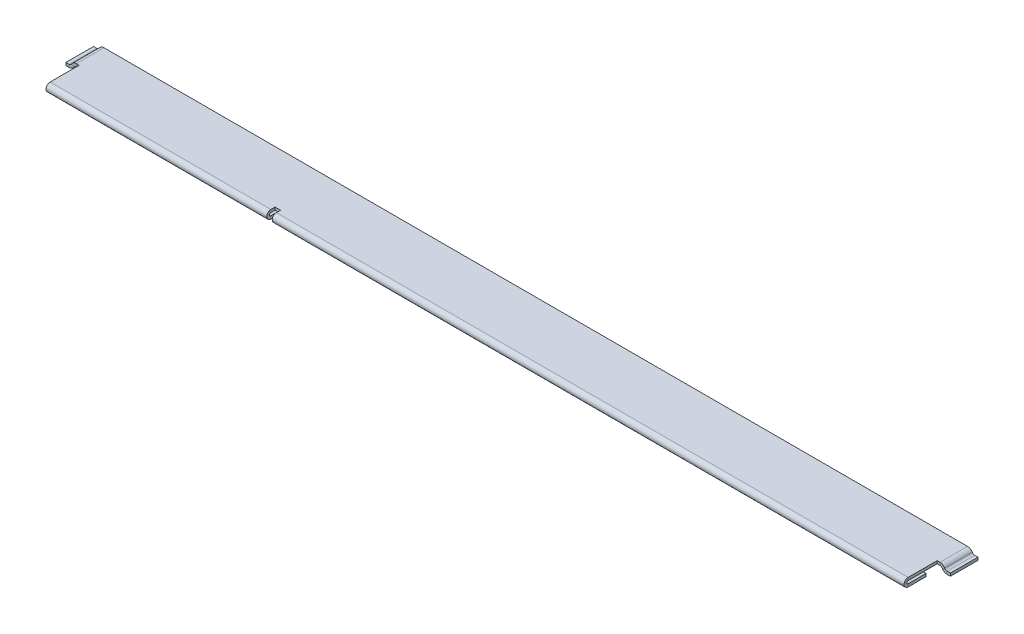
ISO-10303-21;
HEADER;
FILE_DESCRIPTION(('STEP AP214'),'2;1');
FILE_NAME('part.step','',(''),(''),'','','');
FILE_SCHEMA(('AUTOMOTIVE_DESIGN { 1 0 10303 214 1 1 1 1 }'));
ENDSEC;
DATA;
#1=APPLICATION_CONTEXT('core data for automotive mechanical design processes');
#2=APPLICATION_PROTOCOL_DEFINITION('international standard','automotive_design',2000,#1);
#3=PRODUCT_CONTEXT('',#1,'mechanical');
#4=PRODUCT('Part','Part','',(#3));
#5=PRODUCT_RELATED_PRODUCT_CATEGORY('part','',(#4));
#6=PRODUCT_DEFINITION_FORMATION('','',#4);
#7=PRODUCT_DEFINITION_CONTEXT('part definition',#1,'design');
#8=PRODUCT_DEFINITION('design','',#6,#7);
#9=PRODUCT_DEFINITION_SHAPE('','',#8);
#10=(LENGTH_UNIT() NAMED_UNIT(*) SI_UNIT(.MILLI.,.METRE.));
#11=(NAMED_UNIT(*) PLANE_ANGLE_UNIT() SI_UNIT($,.RADIAN.));
#12=(NAMED_UNIT(*) SI_UNIT($,.STERADIAN.) SOLID_ANGLE_UNIT());
#13=UNCERTAINTY_MEASURE_WITH_UNIT(LENGTH_MEASURE(1.E-05),#10,'distance_accuracy_value','');
#14=(GEOMETRIC_REPRESENTATION_CONTEXT(3) GLOBAL_UNCERTAINTY_ASSIGNED_CONTEXT((#13)) GLOBAL_UNIT_ASSIGNED_CONTEXT((#10,
#11,#12)) REPRESENTATION_CONTEXT('',''));
#15=CARTESIAN_POINT('',(0.,0.,0.));
#16=DIRECTION('',(0.,0.,1.));
#17=DIRECTION('',(1.,0.,0.));
#18=AXIS2_PLACEMENT_3D('',#15,#16,#17);
#19=CARTESIAN_POINT('',(-155.5,-0.5,9.5));
#20=DIRECTION('',(-1.,0.,0.));
#21=DIRECTION('',(0.,-1.,0.));
#22=AXIS2_PLACEMENT_3D('',#19,#20,#21);
#23=CYLINDRICAL_SURFACE('',#22,1.5);
#24=CARTESIAN_POINT('',(-75.5,-0.5,9.5));
#25=DIRECTION('',(-1.,0.,0.));
#26=DIRECTION('',(0.,0.,1.));
#27=AXIS2_PLACEMENT_3D('',#24,#25,#26);
#28=CIRCLE('',#27,1.5);
#29=CARTESIAN_POINT('',(-75.5,1.,9.5));
#30=VERTEX_POINT('',#29);
#31=CARTESIAN_POINT('',(-75.5,-2.,9.5));
#32=VERTEX_POINT('',#31);
#33=EDGE_CURVE('E298',#30,#32,#28,.F.);
#34=ORIENTED_EDGE('',*,*,#33,.F.);
#35=DIRECTION('',(-1.,0.,0.));
#36=VECTOR('',#35,1.);
#37=CARTESIAN_POINT('',(-155.5,1.,9.5));
#38=LINE('',#37,#36);
#39=CARTESIAN_POINT('',(-155.5,1.,9.5));
#40=VERTEX_POINT('',#39);
#41=EDGE_CURVE('E430',#40,#30,#38,.F.);
#42=ORIENTED_EDGE('',*,*,#41,.F.);
#43=CARTESIAN_POINT('',(-155.5,-0.5,9.5));
#44=DIRECTION('',(-1.,0.,0.));
#45=DIRECTION('',(0.,0.,1.));
#46=AXIS2_PLACEMENT_3D('',#43,#44,#45);
#47=CIRCLE('',#46,1.5);
#48=CARTESIAN_POINT('',(-155.5,-2.,9.5));
#49=VERTEX_POINT('',#48);
#50=EDGE_CURVE('E442',#49,#40,#47,.T.);
#51=ORIENTED_EDGE('',*,*,#50,.F.);
#52=DIRECTION('',(1.,0.,0.));
#53=VECTOR('',#52,1.);
#54=CARTESIAN_POINT('',(0.,-2.,9.5));
#55=LINE('',#54,#53);
#56=EDGE_CURVE('E462',#49,#32,#55,.T.);
#57=ORIENTED_EDGE('',*,*,#56,.T.);
#58=EDGE_LOOP('',(#34,#42,#51,#57));
#59=FACE_BOUND('',#58,.T.);
#60=ADVANCED_FACE('F47',(#59),#23,.T.);
#61=CARTESIAN_POINT('',(-155.5,-0.5,9.5));
#62=DIRECTION('',(-1.,0.,0.));
#63=DIRECTION('',(0.,-1.,0.));
#64=AXIS2_PLACEMENT_3D('',#61,#62,#63);
#65=CYLINDRICAL_SURFACE('',#64,0.5);
#66=DIRECTION('',(-1.,0.,0.));
#67=VECTOR('',#66,1.);
#68=CARTESIAN_POINT('',(-155.5,0.,9.5));
#69=LINE('',#68,#67);
#70=CARTESIAN_POINT('',(-155.5,0.,9.5));
#71=VERTEX_POINT('',#70);
#72=CARTESIAN_POINT('',(-75.5,0.,9.5));
#73=VERTEX_POINT('',#72);
#74=EDGE_CURVE('E479',#71,#73,#69,.F.);
#75=ORIENTED_EDGE('',*,*,#74,.T.);
#76=CARTESIAN_POINT('',(-75.5,-0.5,9.5));
#77=DIRECTION('',(-1.,0.,0.));
#78=DIRECTION('',(0.,0.,1.));
#79=AXIS2_PLACEMENT_3D('',#76,#77,#78);
#80=CIRCLE('',#79,0.5);
#81=CARTESIAN_POINT('',(-75.5,-1.,9.5));
#82=VERTEX_POINT('',#81);
#83=EDGE_CURVE('E55',#73,#82,#80,.F.);
#84=ORIENTED_EDGE('',*,*,#83,.T.);
#85=DIRECTION('',(1.,0.,0.));
#86=VECTOR('',#85,1.);
#87=CARTESIAN_POINT('',(0.,-1.,9.5));
#88=LINE('',#87,#86);
#89=CARTESIAN_POINT('',(-155.5,-1.,9.5));
#90=VERTEX_POINT('',#89);
#91=EDGE_CURVE('E450',#90,#82,#88,.T.);
#92=ORIENTED_EDGE('',*,*,#91,.F.);
#93=CARTESIAN_POINT('',(-155.5,-0.5,9.5));
#94=DIRECTION('',(-1.,0.,0.));
#95=DIRECTION('',(0.,0.,1.));
#96=AXIS2_PLACEMENT_3D('',#93,#94,#95);
#97=CIRCLE('',#96,0.5);
#98=EDGE_CURVE('E474',#90,#71,#97,.T.);
#99=ORIENTED_EDGE('',*,*,#98,.T.);
#100=EDGE_LOOP('',(#75,#84,#92,#99));
#101=FACE_BOUND('',#100,.T.);
#102=ADVANCED_FACE('F554',(#101),#65,.F.);
#103=CARTESIAN_POINT('',(-160.3,1.,-0.999999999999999));
#104=DIRECTION('',(0.,0.,-1.));
#105=DIRECTION('',(0.,1.,0.));
#106=AXIS2_PLACEMENT_3D('',#103,#104,#105);
#107=PLANE('',#106);
#108=DIRECTION('',(1.,0.,0.));
#109=VECTOR('',#108,1.);
#110=CARTESIAN_POINT('',(-160.3,1.,-0.999999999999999));
#111=LINE('',#110,#109);
#112=CARTESIAN_POINT('',(-156.505299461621,1.,-0.999999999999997));
#113=VERTEX_POINT('',#112);
#114=CARTESIAN_POINT('',(-155.5,1.,-0.999999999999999));
#115=VERTEX_POINT('',#114);
#116=EDGE_CURVE('E425',#113,#115,#111,.T.);
#117=ORIENTED_EDGE('',*,*,#116,.F.);
#118=DIRECTION('',(0.,-1.,0.));
#119=VECTOR('',#118,1.);
#120=CARTESIAN_POINT('',(-156.505299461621,1.,-0.999999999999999));
#121=LINE('',#120,#119);
#122=CARTESIAN_POINT('',(-156.505299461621,0.,-0.999999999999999));
#123=VERTEX_POINT('',#122);
#124=EDGE_CURVE('E529',#113,#123,#121,.T.);
#125=ORIENTED_EDGE('',*,*,#124,.T.);
#126=DIRECTION('',(1.,0.,0.));
#127=VECTOR('',#126,1.);
#128=CARTESIAN_POINT('',(-160.3,0.,-0.999999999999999));
#129=LINE('',#128,#127);
#130=CARTESIAN_POINT('',(-155.5,0.,-0.999999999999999));
#131=VERTEX_POINT('',#130);
#132=EDGE_CURVE('E492',#123,#131,#129,.T.);
#133=ORIENTED_EDGE('',*,*,#132,.T.);
#134=DIRECTION('',(0.,1.,0.));
#135=VECTOR('',#134,1.);
#136=CARTESIAN_POINT('',(-155.5,1.,-0.999999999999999));
#137=LINE('',#136,#135);
#138=EDGE_CURVE('E477',#131,#115,#137,.T.);
#139=ORIENTED_EDGE('',*,*,#138,.T.);
#140=EDGE_LOOP('',(#117,#125,#133,#139));
#141=FACE_BOUND('',#140,.T.);
#142=ADVANCED_FACE('F662',(#141),#107,.F.);
#143=CARTESIAN_POINT('',(155.5,1.,-11.));
#144=DIRECTION('',(0.,-1.,0.));
#145=DIRECTION('',(0.,0.,-1.));
#146=AXIS2_PLACEMENT_3D('',#143,#144,#145);
#147=PLANE('',#146);
#148=ORIENTED_EDGE('',*,*,#41,.T.);
#149=DIRECTION('',(0.,0.,1.));
#150=VECTOR('',#149,1.);
#151=CARTESIAN_POINT('',(-75.5,1.,8.));
#152=LINE('',#151,#150);
#153=CARTESIAN_POINT('',(-75.5,1.,8.));
#154=VERTEX_POINT('',#153);
#155=EDGE_CURVE('E281',#154,#30,#152,.T.);
#156=ORIENTED_EDGE('',*,*,#155,.F.);
#157=DIRECTION('',(-1.,0.,0.));
#158=VECTOR('',#157,1.);
#159=CARTESIAN_POINT('',(-75.5,1.,8.));
#160=LINE('',#159,#158);
#161=CARTESIAN_POINT('',(-73.5,1.,8.));
#162=VERTEX_POINT('',#161);
#163=EDGE_CURVE('E278',#162,#154,#160,.T.);
#164=ORIENTED_EDGE('',*,*,#163,.F.);
#165=DIRECTION('',(0.,0.,-1.));
#166=VECTOR('',#165,1.);
#167=CARTESIAN_POINT('',(-73.5,1.,8.));
#168=LINE('',#167,#166);
#169=CARTESIAN_POINT('',(-73.5,1.,9.5));
#170=VERTEX_POINT('',#169);
#171=EDGE_CURVE('E283',#170,#162,#168,.T.);
#172=ORIENTED_EDGE('',*,*,#171,.F.);
#173=CARTESIAN_POINT('',(155.5,1.,9.5));
#174=VERTEX_POINT('',#173);
#175=EDGE_CURVE('E424',#170,#174,#38,.F.);
#176=ORIENTED_EDGE('',*,*,#175,.T.);
#177=DIRECTION('',(0.,0.,-1.));
#178=VECTOR('',#177,1.);
#179=CARTESIAN_POINT('',(155.5,1.,11.));
#180=LINE('',#179,#178);
#181=CARTESIAN_POINT('',(155.5,1.,-0.999999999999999));
#182=VERTEX_POINT('',#181);
#183=EDGE_CURVE('E426',#174,#182,#180,.T.);
#184=ORIENTED_EDGE('',*,*,#183,.T.);
#185=DIRECTION('',(-1.,0.,0.));
#186=VECTOR('',#185,1.);
#187=CARTESIAN_POINT('',(160.3,1.,-0.999999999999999));
#188=LINE('',#187,#186);
#189=CARTESIAN_POINT('',(156.505299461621,1.,-0.999999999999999));
#190=VERTEX_POINT('',#189);
#191=EDGE_CURVE('E417',#190,#182,#188,.T.);
#192=ORIENTED_EDGE('',*,*,#191,.F.);
#193=DIRECTION('',(0.,0.,1.));
#194=VECTOR('',#193,1.);
#195=CARTESIAN_POINT('',(156.505299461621,1.,-11.));
#196=LINE('',#195,#194);
#197=CARTESIAN_POINT('',(156.505299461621,1.,-11.));
#198=VERTEX_POINT('',#197);
#199=EDGE_CURVE('E495',#198,#190,#196,.T.);
#200=ORIENTED_EDGE('',*,*,#199,.F.);
#201=DIRECTION('',(-1.,0.,0.));
#202=VECTOR('',#201,1.);
#203=CARTESIAN_POINT('',(-155.5,1.,-11.));
#204=LINE('',#203,#202);
#205=CARTESIAN_POINT('',(-156.505299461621,0.999999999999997,-11.));
#206=VERTEX_POINT('',#205);
#207=EDGE_CURVE('E536',#198,#206,#204,.T.);
#208=ORIENTED_EDGE('',*,*,#207,.T.);
#209=DIRECTION('',(0.,0.,1.));
#210=VECTOR('',#209,1.);
#211=CARTESIAN_POINT('',(-156.505299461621,1.,-11.0000000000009));
#212=LINE('',#211,#210);
#213=EDGE_CURVE('E521',#206,#113,#212,.T.);
#214=ORIENTED_EDGE('',*,*,#213,.T.);
#215=ORIENTED_EDGE('',*,*,#116,.T.);
#216=DIRECTION('',(0.,0.,1.));
#217=VECTOR('',#216,1.);
#218=CARTESIAN_POINT('',(-155.5,1.,11.));
#219=LINE('',#218,#217);
#220=EDGE_CURVE('E422',#115,#40,#219,.T.);
#221=ORIENTED_EDGE('',*,*,#220,.T.);
#222=EDGE_LOOP('',(#148,#156,#164,#172,#176,#184,#192,#200,#208,#214,#215,#221));
#223=FACE_BOUND('',#222,.T.);
#224=ADVANCED_FACE('F49',(#223),#147,.F.);
#225=CARTESIAN_POINT('',(-155.5,1.,-11.));
#226=DIRECTION('',(0.,0.,1.));
#227=DIRECTION('',(1.,0.,0.));
#228=AXIS2_PLACEMENT_3D('',#225,#226,#227);
#229=PLANE('',#228);
#230=DIRECTION('',(-1.,0.,0.));
#231=VECTOR('',#230,1.);
#232=CARTESIAN_POINT('',(-155.5,0.,-11.));
#233=LINE('',#232,#231);
#234=CARTESIAN_POINT('',(156.505299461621,0.,-11.));
#235=VERTEX_POINT('',#234);
#236=CARTESIAN_POINT('',(-156.505299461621,0.,-11.));
#237=VERTEX_POINT('',#236);
#238=EDGE_CURVE('E410',#235,#237,#233,.T.);
#239=ORIENTED_EDGE('',*,*,#238,.T.);
#240=DIRECTION('',(0.,1.,0.));
#241=VECTOR('',#240,1.);
#242=CARTESIAN_POINT('',(-156.505299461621,1.,-11.));
#243=LINE('',#242,#241);
#244=EDGE_CURVE('E524',#237,#206,#243,.T.);
#245=ORIENTED_EDGE('',*,*,#244,.T.);
#246=ORIENTED_EDGE('',*,*,#207,.F.);
#247=DIRECTION('',(0.,1.,0.));
#248=VECTOR('',#247,1.);
#249=CARTESIAN_POINT('',(156.505299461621,1.,-11.));
#250=LINE('',#249,#248);
#251=EDGE_CURVE('E504',#235,#198,#250,.T.);
#252=ORIENTED_EDGE('',*,*,#251,.F.);
#253=EDGE_LOOP('',(#239,#245,#246,#252));
#254=FACE_BOUND('',#253,.T.);
#255=ADVANCED_FACE('F963',(#254),#229,.F.);
#256=CARTESIAN_POINT('',(155.5,0.,-11.));
#257=DIRECTION('',(0.,-1.,0.));
#258=DIRECTION('',(0.,0.,-1.));
#259=AXIS2_PLACEMENT_3D('',#256,#257,#258);
#260=PLANE('',#259);
#261=DIRECTION('',(0.,0.,-1.));
#262=VECTOR('',#261,1.);
#263=CARTESIAN_POINT('',(-75.5,0.,-11.));
#264=LINE('',#263,#262);
#265=CARTESIAN_POINT('',(-75.5,0.,8.));
#266=VERTEX_POINT('',#265);
#267=EDGE_CURVE('E296',#73,#266,#264,.T.);
#268=ORIENTED_EDGE('',*,*,#267,.F.);
#269=ORIENTED_EDGE('',*,*,#74,.F.);
#270=DIRECTION('',(0.,0.,1.));
#271=VECTOR('',#270,1.);
#272=CARTESIAN_POINT('',(-155.5,0.,11.));
#273=LINE('',#272,#271);
#274=EDGE_CURVE('E414',#131,#71,#273,.T.);
#275=ORIENTED_EDGE('',*,*,#274,.F.);
#276=ORIENTED_EDGE('',*,*,#132,.F.);
#277=DIRECTION('',(0.,0.,1.));
#278=VECTOR('',#277,1.);
#279=CARTESIAN_POINT('',(-156.505299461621,0.,-11.0000000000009));
#280=LINE('',#279,#278);
#281=EDGE_CURVE('E527',#237,#123,#280,.T.);
#282=ORIENTED_EDGE('',*,*,#281,.F.);
#283=ORIENTED_EDGE('',*,*,#238,.F.);
#284=DIRECTION('',(0.,0.,1.));
#285=VECTOR('',#284,1.);
#286=CARTESIAN_POINT('',(156.505299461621,0.,-11.));
#287=LINE('',#286,#285);
#288=CARTESIAN_POINT('',(156.505299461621,0.,-0.999999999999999));
#289=VERTEX_POINT('',#288);
#290=EDGE_CURVE('E501',#235,#289,#287,.T.);
#291=ORIENTED_EDGE('',*,*,#290,.T.);
#292=DIRECTION('',(-1.,0.,0.));
#293=VECTOR('',#292,1.);
#294=CARTESIAN_POINT('',(160.3,0.,-0.999999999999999));
#295=LINE('',#294,#293);
#296=CARTESIAN_POINT('',(155.5,0.,-0.999999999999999));
#297=VERTEX_POINT('',#296);
#298=EDGE_CURVE('E429',#289,#297,#295,.T.);
#299=ORIENTED_EDGE('',*,*,#298,.T.);
#300=DIRECTION('',(0.,0.,-1.));
#301=VECTOR('',#300,1.);
#302=CARTESIAN_POINT('',(155.5,0.,11.));
#303=LINE('',#302,#301);
#304=CARTESIAN_POINT('',(155.5,0.,9.5));
#305=VERTEX_POINT('',#304);
#306=EDGE_CURVE('E418',#305,#297,#303,.T.);
#307=ORIENTED_EDGE('',*,*,#306,.F.);
#308=CARTESIAN_POINT('',(-73.5,0.,9.5));
#309=VERTEX_POINT('',#308);
#310=EDGE_CURVE('E465',#309,#305,#69,.F.);
#311=ORIENTED_EDGE('',*,*,#310,.F.);
#312=DIRECTION('',(0.,0.,1.));
#313=VECTOR('',#312,1.);
#314=CARTESIAN_POINT('',(-73.5,0.,-10.9999999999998));
#315=LINE('',#314,#313);
#316=CARTESIAN_POINT('',(-73.5,0.,8.));
#317=VERTEX_POINT('',#316);
#318=EDGE_CURVE('E69',#317,#309,#315,.T.);
#319=ORIENTED_EDGE('',*,*,#318,.F.);
#320=DIRECTION('',(1.,0.,0.));
#321=VECTOR('',#320,1.);
#322=CARTESIAN_POINT('',(155.5,0.,8.));
#323=LINE('',#322,#321);
#324=EDGE_CURVE('E300',#266,#317,#323,.T.);
#325=ORIENTED_EDGE('',*,*,#324,.F.);
#326=EDGE_LOOP('',(#268,#269,#275,#276,#282,#283,#291,#299,#307,#311,#319,#325));
#327=FACE_BOUND('',#326,.T.);
#328=ADVANCED_FACE('F584',(#327),#260,.T.);
#329=CARTESIAN_POINT('',(160.3,1.,-0.999999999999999));
#330=DIRECTION('',(0.,0.,1.));
#331=DIRECTION('',(0.,-1.,0.));
#332=AXIS2_PLACEMENT_3D('',#329,#330,#331);
#333=PLANE('',#332);
#334=ORIENTED_EDGE('',*,*,#298,.F.);
#335=DIRECTION('',(0.,1.,0.));
#336=VECTOR('',#335,1.);
#337=CARTESIAN_POINT('',(156.505299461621,1.,-0.999999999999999));
#338=LINE('',#337,#336);
#339=EDGE_CURVE('E498',#289,#190,#338,.T.);
#340=ORIENTED_EDGE('',*,*,#339,.T.);
#341=ORIENTED_EDGE('',*,*,#191,.T.);
#342=DIRECTION('',(0.,1.,0.));
#343=VECTOR('',#342,1.);
#344=CARTESIAN_POINT('',(155.5,1.,-0.999999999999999));
#345=LINE('',#344,#343);
#346=EDGE_CURVE('E421',#297,#182,#345,.T.);
#347=ORIENTED_EDGE('',*,*,#346,.F.);
#348=EDGE_LOOP('',(#334,#340,#341,#347));
#349=FACE_BOUND('',#348,.T.);
#350=ADVANCED_FACE('F608',(#349),#333,.T.);
#351=CARTESIAN_POINT('',(-155.5,1.,11.));
#352=DIRECTION('',(1.,0.,0.));
#353=DIRECTION('',(0.,0.,-1.));
#354=AXIS2_PLACEMENT_3D('',#351,#352,#353);
#355=PLANE('',#354);
#356=ORIENTED_EDGE('',*,*,#138,.F.);
#357=ORIENTED_EDGE('',*,*,#274,.T.);
#358=DIRECTION('',(0.,1.,0.));
#359=VECTOR('',#358,1.);
#360=CARTESIAN_POINT('',(-155.5,0.,9.5));
#361=LINE('',#360,#359);
#362=EDGE_CURVE('E416',#71,#40,#361,.T.);
#363=ORIENTED_EDGE('',*,*,#362,.T.);
#364=ORIENTED_EDGE('',*,*,#220,.F.);
#365=EDGE_LOOP('',(#356,#357,#363,#364));
#366=FACE_BOUND('',#365,.T.);
#367=ADVANCED_FACE('F580',(#366),#355,.F.);
#368=CARTESIAN_POINT('',(155.5,1.,11.));
#369=DIRECTION('',(-1.,0.,0.));
#370=DIRECTION('',(0.,0.,1.));
#371=AXIS2_PLACEMENT_3D('',#368,#369,#370);
#372=PLANE('',#371);
#373=ORIENTED_EDGE('',*,*,#306,.T.);
#374=ORIENTED_EDGE('',*,*,#346,.T.);
#375=ORIENTED_EDGE('',*,*,#183,.F.);
#376=DIRECTION('',(0.,1.,0.));
#377=VECTOR('',#376,1.);
#378=CARTESIAN_POINT('',(155.5,0.,9.5));
#379=LINE('',#378,#377);
#380=EDGE_CURVE('E449',#305,#174,#379,.T.);
#381=ORIENTED_EDGE('',*,*,#380,.F.);
#382=EDGE_LOOP('',(#373,#374,#375,#381));
#383=FACE_BOUND('',#382,.T.);
#384=ADVANCED_FACE('F602',(#383),#372,.F.);
#385=CARTESIAN_POINT('',(-155.5,-2.,6.25));
#386=DIRECTION('',(1.,0.,0.));
#387=DIRECTION('',(0.,0.,1.));
#388=AXIS2_PLACEMENT_3D('',#385,#386,#387);
#389=PLANE('',#388);
#390=DIRECTION('',(0.,-1.,0.));
#391=VECTOR('',#390,1.);
#392=CARTESIAN_POINT('',(-155.5,-2.,9.5));
#393=LINE('',#392,#391);
#394=EDGE_CURVE('E439',#90,#49,#393,.T.);
#395=ORIENTED_EDGE('',*,*,#394,.F.);
#396=DIRECTION('',(0.,0.,-1.));
#397=VECTOR('',#396,1.);
#398=CARTESIAN_POINT('',(-155.5,-1.,6.25));
#399=LINE('',#398,#397);
#400=CARTESIAN_POINT('',(-155.5,-1.,3.));
#401=VERTEX_POINT('',#400);
#402=EDGE_CURVE('E454',#401,#90,#399,.F.);
#403=ORIENTED_EDGE('',*,*,#402,.F.);
#404=DIRECTION('',(0.,-1.,0.));
#405=VECTOR('',#404,1.);
#406=CARTESIAN_POINT('',(-155.5,-2.,3.));
#407=LINE('',#406,#405);
#408=CARTESIAN_POINT('',(-155.5,-2.,3.));
#409=VERTEX_POINT('',#408);
#410=EDGE_CURVE('E444',#401,#409,#407,.T.);
#411=ORIENTED_EDGE('',*,*,#410,.T.);
#412=DIRECTION('',(0.,0.,1.));
#413=VECTOR('',#412,1.);
#414=CARTESIAN_POINT('',(-155.5,-2.,6.25));
#415=LINE('',#414,#413);
#416=EDGE_CURVE('E434',#409,#49,#415,.T.);
#417=ORIENTED_EDGE('',*,*,#416,.T.);
#418=EDGE_LOOP('',(#395,#403,#411,#417));
#419=FACE_BOUND('',#418,.T.);
#420=ADVANCED_FACE('F564',(#419),#389,.F.);
#421=CARTESIAN_POINT('',(0.,-2.,3.));
#422=DIRECTION('',(0.,0.,1.));
#423=DIRECTION('',(-1.,0.,0.));
#424=AXIS2_PLACEMENT_3D('',#421,#422,#423);
#425=PLANE('',#424);
#426=ORIENTED_EDGE('',*,*,#410,.F.);
#427=DIRECTION('',(1.,0.,0.));
#428=VECTOR('',#427,1.);
#429=CARTESIAN_POINT('',(0.,-1.,3.));
#430=LINE('',#429,#428);
#431=CARTESIAN_POINT('',(155.5,-1.,3.));
#432=VERTEX_POINT('',#431);
#433=EDGE_CURVE('E457',#432,#401,#430,.F.);
#434=ORIENTED_EDGE('',*,*,#433,.F.);
#435=DIRECTION('',(0.,-1.,0.));
#436=VECTOR('',#435,1.);
#437=CARTESIAN_POINT('',(155.5,-2.,3.));
#438=LINE('',#437,#436);
#439=CARTESIAN_POINT('',(155.5,-2.,3.));
#440=VERTEX_POINT('',#439);
#441=EDGE_CURVE('E431',#432,#440,#438,.T.);
#442=ORIENTED_EDGE('',*,*,#441,.T.);
#443=DIRECTION('',(-1.,0.,0.));
#444=VECTOR('',#443,1.);
#445=CARTESIAN_POINT('',(0.,-2.,3.));
#446=LINE('',#445,#444);
#447=EDGE_CURVE('E433',#440,#409,#446,.T.);
#448=ORIENTED_EDGE('',*,*,#447,.T.);
#449=EDGE_LOOP('',(#426,#434,#442,#448));
#450=FACE_BOUND('',#449,.T.);
#451=ADVANCED_FACE('F683',(#450),#425,.F.);
#452=CARTESIAN_POINT('',(155.5,-2.,6.25));
#453=DIRECTION('',(-1.,0.,0.));
#454=DIRECTION('',(0.,0.,-1.));
#455=AXIS2_PLACEMENT_3D('',#452,#453,#454);
#456=PLANE('',#455);
#457=DIRECTION('',(0.,0.,-1.));
#458=VECTOR('',#457,1.);
#459=CARTESIAN_POINT('',(155.5,-1.,6.25));
#460=LINE('',#459,#458);
#461=CARTESIAN_POINT('',(155.5,-1.,9.5));
#462=VERTEX_POINT('',#461);
#463=EDGE_CURVE('E446',#462,#432,#460,.T.);
#464=ORIENTED_EDGE('',*,*,#463,.F.);
#465=DIRECTION('',(0.,-1.,0.));
#466=VECTOR('',#465,1.);
#467=CARTESIAN_POINT('',(155.5,-2.,9.5));
#468=LINE('',#467,#466);
#469=CARTESIAN_POINT('',(155.5,-2.,9.5));
#470=VERTEX_POINT('',#469);
#471=EDGE_CURVE('E435',#462,#470,#468,.T.);
#472=ORIENTED_EDGE('',*,*,#471,.T.);
#473=DIRECTION('',(0.,0.,-1.));
#474=VECTOR('',#473,1.);
#475=CARTESIAN_POINT('',(155.5,-2.,6.25));
#476=LINE('',#475,#474);
#477=EDGE_CURVE('E438',#470,#440,#476,.T.);
#478=ORIENTED_EDGE('',*,*,#477,.T.);
#479=ORIENTED_EDGE('',*,*,#441,.F.);
#480=EDGE_LOOP('',(#464,#472,#478,#479));
#481=FACE_BOUND('',#480,.T.);
#482=ADVANCED_FACE('F680',(#481),#456,.F.);
#483=CARTESIAN_POINT('',(0.,-2.,6.25));
#484=DIRECTION('',(0.,-1.,0.));
#485=DIRECTION('',(0.,0.,-1.));
#486=AXIS2_PLACEMENT_3D('',#483,#484,#485);
#487=PLANE('',#486);
#488=DIRECTION('',(0.,0.,1.));
#489=VECTOR('',#488,1.);
#490=CARTESIAN_POINT('',(-75.5,-2.,8.));
#491=LINE('',#490,#489);
#492=CARTESIAN_POINT('',(-75.5,-2.,8.));
#493=VERTEX_POINT('',#492);
#494=EDGE_CURVE('E276',#493,#32,#491,.T.);
#495=ORIENTED_EDGE('',*,*,#494,.T.);
#496=ORIENTED_EDGE('',*,*,#56,.F.);
#497=ORIENTED_EDGE('',*,*,#416,.F.);
#498=ORIENTED_EDGE('',*,*,#447,.F.);
#499=ORIENTED_EDGE('',*,*,#477,.F.);
#500=CARTESIAN_POINT('',(-73.5,-2.,9.5));
#501=VERTEX_POINT('',#500);
#502=EDGE_CURVE('E275',#501,#470,#55,.T.);
#503=ORIENTED_EDGE('',*,*,#502,.F.);
#504=DIRECTION('',(0.,0.,-1.));
#505=VECTOR('',#504,1.);
#506=CARTESIAN_POINT('',(-73.5,-2.,8.));
#507=LINE('',#506,#505);
#508=CARTESIAN_POINT('',(-73.5,-2.,8.));
#509=VERTEX_POINT('',#508);
#510=EDGE_CURVE('E62',#501,#509,#507,.T.);
#511=ORIENTED_EDGE('',*,*,#510,.T.);
#512=DIRECTION('',(-1.,0.,0.));
#513=VECTOR('',#512,1.);
#514=CARTESIAN_POINT('',(-75.5,-2.,8.));
#515=LINE('',#514,#513);
#516=EDGE_CURVE('E264',#509,#493,#515,.T.);
#517=ORIENTED_EDGE('',*,*,#516,.T.);
#518=EDGE_LOOP('',(#495,#496,#497,#498,#499,#503,#511,#517));
#519=FACE_BOUND('',#518,.T.);
#520=ADVANCED_FACE('F273',(#519),#487,.T.);
#521=CARTESIAN_POINT('',(0.,-1.,6.25));
#522=DIRECTION('',(0.,-1.,0.));
#523=DIRECTION('',(0.,0.,-1.));
#524=AXIS2_PLACEMENT_3D('',#521,#522,#523);
#525=PLANE('',#524);
#526=ORIENTED_EDGE('',*,*,#91,.T.);
#527=DIRECTION('',(0.,0.,-1.));
#528=VECTOR('',#527,1.);
#529=CARTESIAN_POINT('',(-75.5,-1.,6.25));
#530=LINE('',#529,#528);
#531=CARTESIAN_POINT('',(-75.5,-1.,8.));
#532=VERTEX_POINT('',#531);
#533=EDGE_CURVE('E293',#82,#532,#530,.T.);
#534=ORIENTED_EDGE('',*,*,#533,.T.);
#535=DIRECTION('',(1.,0.,0.));
#536=VECTOR('',#535,1.);
#537=CARTESIAN_POINT('',(0.,-1.,8.));
#538=LINE('',#537,#536);
#539=CARTESIAN_POINT('',(-73.5,-1.,8.));
#540=VERTEX_POINT('',#539);
#541=EDGE_CURVE('E12',#532,#540,#538,.T.);
#542=ORIENTED_EDGE('',*,*,#541,.T.);
#543=DIRECTION('',(0.,0.,1.));
#544=VECTOR('',#543,1.);
#545=CARTESIAN_POINT('',(-73.5,-1.,6.25000000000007));
#546=LINE('',#545,#544);
#547=CARTESIAN_POINT('',(-73.5,-1.,9.5));
#548=VERTEX_POINT('',#547);
#549=EDGE_CURVE('E258',#540,#548,#546,.T.);
#550=ORIENTED_EDGE('',*,*,#549,.T.);
#551=EDGE_CURVE('E453',#548,#462,#88,.T.);
#552=ORIENTED_EDGE('',*,*,#551,.T.);
#553=ORIENTED_EDGE('',*,*,#463,.T.);
#554=ORIENTED_EDGE('',*,*,#433,.T.);
#555=ORIENTED_EDGE('',*,*,#402,.T.);
#556=EDGE_LOOP('',(#526,#534,#542,#550,#552,#553,#554,#555));
#557=FACE_BOUND('',#556,.T.);
#558=ADVANCED_FACE('F560',(#557),#525,.F.);
#559=CARTESIAN_POINT('',(155.5,-0.5,9.5));
#560=DIRECTION('',(1.,0.,0.));
#561=DIRECTION('',(0.,0.,-1.));
#562=AXIS2_PLACEMENT_3D('',#559,#560,#561);
#563=PLANE('',#562);
#564=ORIENTED_EDGE('',*,*,#471,.F.);
#565=CARTESIAN_POINT('',(155.5,-0.5,9.5));
#566=DIRECTION('',(-1.,0.,0.));
#567=DIRECTION('',(0.,0.,1.));
#568=AXIS2_PLACEMENT_3D('',#565,#566,#567);
#569=CIRCLE('',#568,0.5);
#570=EDGE_CURVE('E478',#305,#462,#569,.F.);
#571=ORIENTED_EDGE('',*,*,#570,.F.);
#572=ORIENTED_EDGE('',*,*,#380,.T.);
#573=CARTESIAN_POINT('',(155.5,-0.5,9.5));
#574=DIRECTION('',(-1.,0.,0.));
#575=DIRECTION('',(0.,0.,1.));
#576=AXIS2_PLACEMENT_3D('',#573,#574,#575);
#577=CIRCLE('',#576,1.5);
#578=EDGE_CURVE('E443',#174,#470,#577,.F.);
#579=ORIENTED_EDGE('',*,*,#578,.T.);
#580=EDGE_LOOP('',(#564,#571,#572,#579));
#581=FACE_BOUND('',#580,.T.);
#582=ADVANCED_FACE('F598',(#581),#563,.T.);
#583=CARTESIAN_POINT('',(-155.5,-0.5,9.5));
#584=DIRECTION('',(1.,0.,0.));
#585=DIRECTION('',(0.,0.,-1.));
#586=AXIS2_PLACEMENT_3D('',#583,#584,#585);
#587=PLANE('',#586);
#588=ORIENTED_EDGE('',*,*,#98,.F.);
#589=ORIENTED_EDGE('',*,*,#394,.T.);
#590=ORIENTED_EDGE('',*,*,#50,.T.);
#591=ORIENTED_EDGE('',*,*,#362,.F.);
#592=EDGE_LOOP('',(#588,#589,#590,#591));
#593=FACE_BOUND('',#592,.T.);
#594=ADVANCED_FACE('F568',(#593),#587,.F.);
#595=CARTESIAN_POINT('',(-73.5,-0.5,9.5));
#596=DIRECTION('',(1.,0.,0.));
#597=DIRECTION('',(0.,0.,-1.));
#598=AXIS2_PLACEMENT_3D('',#595,#596,#597);
#599=CIRCLE('',#598,1.5);
#600=EDGE_CURVE('E291',#501,#170,#599,.F.);
#601=ORIENTED_EDGE('',*,*,#600,.F.);
#602=ORIENTED_EDGE('',*,*,#502,.T.);
#603=ORIENTED_EDGE('',*,*,#578,.F.);
#604=ORIENTED_EDGE('',*,*,#175,.F.);
#605=EDGE_LOOP('',(#601,#602,#603,#604));
#606=FACE_BOUND('',#605,.T.);
#607=ADVANCED_FACE('F595',(#606),#23,.T.);
#608=ORIENTED_EDGE('',*,*,#551,.F.);
#609=CARTESIAN_POINT('',(-73.5,-0.5,9.5));
#610=DIRECTION('',(1.,0.,0.));
#611=DIRECTION('',(0.,0.,-1.));
#612=AXIS2_PLACEMENT_3D('',#609,#610,#611);
#613=CIRCLE('',#612,0.5);
#614=EDGE_CURVE('E550',#548,#309,#613,.F.);
#615=ORIENTED_EDGE('',*,*,#614,.T.);
#616=ORIENTED_EDGE('',*,*,#310,.T.);
#617=ORIENTED_EDGE('',*,*,#570,.T.);
#618=EDGE_LOOP('',(#608,#615,#616,#617));
#619=FACE_BOUND('',#618,.T.);
#620=ADVANCED_FACE('F664',(#619),#65,.F.);
#621=CARTESIAN_POINT('',(156.505299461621,-1.,-11.));
#622=DIRECTION('',(0.,0.,-1.));
#623=DIRECTION('',(-1.,0.,0.));
#624=AXIS2_PLACEMENT_3D('',#621,#622,#623);
#625=PLANE('',#624);
#626=DIRECTION('',(0.86602540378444,0.499999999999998,0.));
#627=VECTOR('',#626,1.);
#628=CARTESIAN_POINT('',(158.23735026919,0.,-11.));
#629=LINE('',#628,#627);
#630=CARTESIAN_POINT('',(157.371324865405,-0.5,-11.));
#631=VERTEX_POINT('',#630);
#632=CARTESIAN_POINT('',(158.23735026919,0.,-11.));
#633=VERTEX_POINT('',#632);
#634=EDGE_CURVE('E518',#631,#633,#629,.T.);
#635=ORIENTED_EDGE('',*,*,#634,.F.);
#636=CARTESIAN_POINT('',(156.505299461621,-1.,-11.));
#637=DIRECTION('',(0.,0.,-1.));
#638=DIRECTION('',(-1.,0.,0.));
#639=AXIS2_PLACEMENT_3D('',#636,#637,#638);
#640=CIRCLE('',#639,1.);
#641=EDGE_CURVE('E399',#631,#235,#640,.F.);
#642=ORIENTED_EDGE('',*,*,#641,.T.);
#643=ORIENTED_EDGE('',*,*,#251,.T.);
#644=CARTESIAN_POINT('',(156.505299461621,-1.,-11.));
#645=DIRECTION('',(0.,0.,1.));
#646=DIRECTION('',(1.,0.,0.));
#647=AXIS2_PLACEMENT_3D('',#644,#645,#646);
#648=CIRCLE('',#647,2.);
#649=EDGE_CURVE('E404',#633,#198,#648,.T.);
#650=ORIENTED_EDGE('',*,*,#649,.F.);
#651=EDGE_LOOP('',(#635,#642,#643,#650));
#652=FACE_BOUND('',#651,.T.);
#653=ADVANCED_FACE('F671',(#652),#625,.T.);
#654=CARTESIAN_POINT('',(156.505299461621,-1.,-0.999999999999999));
#655=DIRECTION('',(0.,0.,1.));
#656=DIRECTION('',(1.,0.,0.));
#657=AXIS2_PLACEMENT_3D('',#654,#655,#656);
#658=PLANE('',#657);
#659=ORIENTED_EDGE('',*,*,#339,.F.);
#660=CARTESIAN_POINT('',(156.505299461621,-1.,-0.999999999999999));
#661=DIRECTION('',(0.,0.,-1.));
#662=DIRECTION('',(-1.,0.,0.));
#663=AXIS2_PLACEMENT_3D('',#660,#661,#662);
#664=CIRCLE('',#663,1.);
#665=CARTESIAN_POINT('',(157.371324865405,-0.5,-0.999999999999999));
#666=VERTEX_POINT('',#665);
#667=EDGE_CURVE('E408',#289,#666,#664,.T.);
#668=ORIENTED_EDGE('',*,*,#667,.T.);
#669=DIRECTION('',(0.86602540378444,0.499999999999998,0.));
#670=VECTOR('',#669,1.);
#671=CARTESIAN_POINT('',(158.23735026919,0.,-0.999999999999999));
#672=LINE('',#671,#670);
#673=CARTESIAN_POINT('',(158.23735026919,0.,-0.999999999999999));
#674=VERTEX_POINT('',#673);
#675=EDGE_CURVE('E512',#666,#674,#672,.T.);
#676=ORIENTED_EDGE('',*,*,#675,.T.);
#677=CARTESIAN_POINT('',(156.505299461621,-1.,-0.999999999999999));
#678=DIRECTION('',(0.,0.,-1.));
#679=DIRECTION('',(1.,0.,0.));
#680=AXIS2_PLACEMENT_3D('',#677,#678,#679);
#681=CIRCLE('',#680,2.);
#682=EDGE_CURVE('E407',#190,#674,#681,.T.);
#683=ORIENTED_EDGE('',*,*,#682,.F.);
#684=EDGE_LOOP('',(#659,#668,#676,#683));
#685=FACE_BOUND('',#684,.T.);
#686=ADVANCED_FACE('F615',(#685),#658,.T.);
#687=CARTESIAN_POINT('',(156.505299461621,-1.,4.14546378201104));
#688=DIRECTION('',(0.,0.,-1.));
#689=DIRECTION('',(-1.,0.,0.));
#690=AXIS2_PLACEMENT_3D('',#687,#688,#689);
#691=CYLINDRICAL_SURFACE('',#690,2.);
#692=ORIENTED_EDGE('',*,*,#682,.T.);
#693=DIRECTION('',(0.,0.,1.));
#694=VECTOR('',#693,1.);
#695=CARTESIAN_POINT('',(158.23735026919,0.,-11.));
#696=LINE('',#695,#694);
#697=EDGE_CURVE('E507',#633,#674,#696,.T.);
#698=ORIENTED_EDGE('',*,*,#697,.F.);
#699=ORIENTED_EDGE('',*,*,#649,.T.);
#700=ORIENTED_EDGE('',*,*,#199,.T.);
#701=EDGE_LOOP('',(#692,#698,#699,#700));
#702=FACE_BOUND('',#701,.T.);
#703=ADVANCED_FACE('F613',(#702),#691,.T.);
#704=CARTESIAN_POINT('',(156.505299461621,-1.,4.14546378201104));
#705=DIRECTION('',(0.,0.,-1.));
#706=DIRECTION('',(-1.,0.,0.));
#707=AXIS2_PLACEMENT_3D('',#704,#705,#706);
#708=CYLINDRICAL_SURFACE('',#707,1.);
#709=ORIENTED_EDGE('',*,*,#667,.F.);
#710=ORIENTED_EDGE('',*,*,#290,.F.);
#711=ORIENTED_EDGE('',*,*,#641,.F.);
#712=DIRECTION('',(0.,0.,1.));
#713=VECTOR('',#712,1.);
#714=CARTESIAN_POINT('',(157.371324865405,-0.5,-11.));
#715=LINE('',#714,#713);
#716=EDGE_CURVE('E515',#631,#666,#715,.T.);
#717=ORIENTED_EDGE('',*,*,#716,.T.);
#718=EDGE_LOOP('',(#709,#710,#711,#717));
#719=FACE_BOUND('',#718,.T.);
#720=ADVANCED_FACE('F702',(#719),#708,.F.);
#721=CARTESIAN_POINT('',(159.103375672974,0.499999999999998,-11.));
#722=DIRECTION('',(0.,0.,1.));
#723=DIRECTION('',(1.,0.,0.));
#724=AXIS2_PLACEMENT_3D('',#721,#722,#723);
#725=PLANE('',#724);
#726=DIRECTION('',(0.,1.,0.));
#727=VECTOR('',#726,1.);
#728=CARTESIAN_POINT('',(159.103375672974,-0.5,-11.));
#729=LINE('',#728,#727);
#730=CARTESIAN_POINT('',(159.103375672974,-1.5,-11.));
#731=VERTEX_POINT('',#730);
#732=CARTESIAN_POINT('',(159.103375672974,-0.500000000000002,-11.));
#733=VERTEX_POINT('',#732);
#734=EDGE_CURVE('E364',#731,#733,#729,.T.);
#735=ORIENTED_EDGE('',*,*,#734,.F.);
#736=CARTESIAN_POINT('',(159.103375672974,0.499999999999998,-11.));
#737=DIRECTION('',(0.,0.,-1.));
#738=DIRECTION('',(-1.,0.,0.));
#739=AXIS2_PLACEMENT_3D('',#736,#737,#738);
#740=CIRCLE('',#739,2.);
#741=EDGE_CURVE('E363',#731,#631,#740,.T.);
#742=ORIENTED_EDGE('',*,*,#741,.T.);
#743=ORIENTED_EDGE('',*,*,#634,.T.);
#744=CARTESIAN_POINT('',(159.103375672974,0.499999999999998,-11.));
#745=DIRECTION('',(0.,0.,-1.));
#746=DIRECTION('',(-1.,0.,0.));
#747=AXIS2_PLACEMENT_3D('',#744,#745,#746);
#748=CIRCLE('',#747,1.);
#749=EDGE_CURVE('E392',#733,#633,#748,.T.);
#750=ORIENTED_EDGE('',*,*,#749,.F.);
#751=EDGE_LOOP('',(#735,#742,#743,#750));
#752=FACE_BOUND('',#751,.T.);
#753=ADVANCED_FACE('F638',(#752),#725,.F.);
#754=CARTESIAN_POINT('',(159.103375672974,0.499999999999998,-0.999999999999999));
#755=DIRECTION('',(0.,0.,-1.));
#756=DIRECTION('',(-1.,0.,0.));
#757=AXIS2_PLACEMENT_3D('',#754,#755,#756);
#758=PLANE('',#757);
#759=CARTESIAN_POINT('',(159.103375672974,0.499999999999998,-0.999999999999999));
#760=DIRECTION('',(0.,0.,-1.));
#761=DIRECTION('',(-1.,0.,0.));
#762=AXIS2_PLACEMENT_3D('',#759,#760,#761);
#763=CIRCLE('',#762,2.);
#764=CARTESIAN_POINT('',(159.103375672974,-1.5,-0.999999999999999));
#765=VERTEX_POINT('',#764);
#766=EDGE_CURVE('E396',#666,#765,#763,.F.);
#767=ORIENTED_EDGE('',*,*,#766,.T.);
#768=DIRECTION('',(0.,1.,0.));
#769=VECTOR('',#768,1.);
#770=CARTESIAN_POINT('',(159.103375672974,-0.5,-0.999999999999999));
#771=LINE('',#770,#769);
#772=CARTESIAN_POINT('',(159.103375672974,-0.5,-0.999999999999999));
#773=VERTEX_POINT('',#772);
#774=EDGE_CURVE('E387',#765,#773,#771,.T.);
#775=ORIENTED_EDGE('',*,*,#774,.T.);
#776=CARTESIAN_POINT('',(159.103375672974,0.499999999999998,-0.999999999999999));
#777=DIRECTION('',(0.,0.,1.));
#778=DIRECTION('',(-1.,0.,0.));
#779=AXIS2_PLACEMENT_3D('',#776,#777,#778);
#780=CIRCLE('',#779,1.);
#781=EDGE_CURVE('E395',#674,#773,#780,.T.);
#782=ORIENTED_EDGE('',*,*,#781,.F.);
#783=ORIENTED_EDGE('',*,*,#675,.F.);
#784=EDGE_LOOP('',(#767,#775,#782,#783));
#785=FACE_BOUND('',#784,.T.);
#786=ADVANCED_FACE('F624',(#785),#758,.F.);
#787=CARTESIAN_POINT('',(159.103375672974,0.499999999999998,4.26337900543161));
#788=DIRECTION('',(0.,0.,-1.));
#789=DIRECTION('',(-1.,0.,0.));
#790=AXIS2_PLACEMENT_3D('',#787,#788,#789);
#791=CYLINDRICAL_SURFACE('',#790,1.);
#792=ORIENTED_EDGE('',*,*,#697,.T.);
#793=ORIENTED_EDGE('',*,*,#781,.T.);
#794=DIRECTION('',(0.,0.,1.));
#795=VECTOR('',#794,1.);
#796=CARTESIAN_POINT('',(159.103375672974,-0.5,-11.));
#797=LINE('',#796,#795);
#798=EDGE_CURVE('E382',#733,#773,#797,.T.);
#799=ORIENTED_EDGE('',*,*,#798,.F.);
#800=ORIENTED_EDGE('',*,*,#749,.T.);
#801=EDGE_LOOP('',(#792,#793,#799,#800));
#802=FACE_BOUND('',#801,.T.);
#803=ADVANCED_FACE('F621',(#802),#791,.F.);
#804=CARTESIAN_POINT('',(159.103375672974,0.499999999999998,4.26337900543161));
#805=DIRECTION('',(0.,0.,-1.));
#806=DIRECTION('',(-1.,0.,0.));
#807=AXIS2_PLACEMENT_3D('',#804,#805,#806);
#808=CYLINDRICAL_SURFACE('',#807,2.);
#809=ORIENTED_EDGE('',*,*,#716,.F.);
#810=ORIENTED_EDGE('',*,*,#741,.F.);
#811=DIRECTION('',(0.,0.,1.));
#812=VECTOR('',#811,1.);
#813=CARTESIAN_POINT('',(159.103375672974,-1.5,-11.));
#814=LINE('',#813,#812);
#815=EDGE_CURVE('E355',#731,#765,#814,.T.);
#816=ORIENTED_EDGE('',*,*,#815,.T.);
#817=ORIENTED_EDGE('',*,*,#766,.F.);
#818=EDGE_LOOP('',(#809,#810,#816,#817));
#819=FACE_BOUND('',#818,.T.);
#820=ADVANCED_FACE('F633',(#819),#808,.T.);
#821=CARTESIAN_POINT('',(160.3,-1.5,-11.));
#822=DIRECTION('',(1.,0.,0.));
#823=DIRECTION('',(0.,0.,1.));
#824=AXIS2_PLACEMENT_3D('',#821,#822,#823);
#825=PLANE('',#824);
#826=DIRECTION('',(0.,-1.,0.));
#827=VECTOR('',#826,1.);
#828=CARTESIAN_POINT('',(160.3,-0.499999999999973,-11.));
#829=LINE('',#828,#827);
#830=CARTESIAN_POINT('',(160.3,-0.499999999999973,-11.));
#831=VERTEX_POINT('',#830);
#832=CARTESIAN_POINT('',(160.3,-1.5,-11.));
#833=VERTEX_POINT('',#832);
#834=EDGE_CURVE('E360',#831,#833,#829,.T.);
#835=ORIENTED_EDGE('',*,*,#834,.F.);
#836=DIRECTION('',(0.,0.,-1.));
#837=VECTOR('',#836,1.);
#838=CARTESIAN_POINT('',(160.3,-0.499999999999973,-11.));
#839=LINE('',#838,#837);
#840=CARTESIAN_POINT('',(160.3,-0.499999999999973,-0.999999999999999));
#841=VERTEX_POINT('',#840);
#842=EDGE_CURVE('E379',#841,#831,#839,.T.);
#843=ORIENTED_EDGE('',*,*,#842,.F.);
#844=DIRECTION('',(0.,1.,0.));
#845=VECTOR('',#844,1.);
#846=CARTESIAN_POINT('',(160.3,-0.499999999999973,-0.999999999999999));
#847=LINE('',#846,#845);
#848=CARTESIAN_POINT('',(160.3,-1.5,-0.999999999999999));
#849=VERTEX_POINT('',#848);
#850=EDGE_CURVE('E376',#849,#841,#847,.T.);
#851=ORIENTED_EDGE('',*,*,#850,.F.);
#852=DIRECTION('',(0.,0.,1.));
#853=VECTOR('',#852,1.);
#854=CARTESIAN_POINT('',(160.3,-1.5,-11.));
#855=LINE('',#854,#853);
#856=EDGE_CURVE('E370',#833,#849,#855,.T.);
#857=ORIENTED_EDGE('',*,*,#856,.F.);
#858=EDGE_LOOP('',(#835,#843,#851,#857));
#859=FACE_BOUND('',#858,.T.);
#860=ADVANCED_FACE('F646',(#859),#825,.T.);
#861=CARTESIAN_POINT('',(155.319274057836,-0.5,-11.));
#862=DIRECTION('',(0.,-1.,0.));
#863=DIRECTION('',(0.,0.,-1.));
#864=AXIS2_PLACEMENT_3D('',#861,#862,#863);
#865=PLANE('',#864);
#866=DIRECTION('',(-1.,0.,0.));
#867=VECTOR('',#866,1.);
#868=CARTESIAN_POINT('',(-155.680725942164,-0.5,-11.));
#869=LINE('',#868,#867);
#870=EDGE_CURVE('E384',#831,#733,#869,.T.);
#871=ORIENTED_EDGE('',*,*,#870,.T.);
#872=ORIENTED_EDGE('',*,*,#798,.T.);
#873=DIRECTION('',(-1.,0.,0.));
#874=VECTOR('',#873,1.);
#875=CARTESIAN_POINT('',(160.119274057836,-0.5,-0.999999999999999));
#876=LINE('',#875,#874);
#877=EDGE_CURVE('E373',#841,#773,#876,.T.);
#878=ORIENTED_EDGE('',*,*,#877,.F.);
#879=ORIENTED_EDGE('',*,*,#842,.T.);
#880=EDGE_LOOP('',(#871,#872,#878,#879));
#881=FACE_BOUND('',#880,.T.);
#882=ADVANCED_FACE('F643',(#881),#865,.F.);
#883=CARTESIAN_POINT('',(160.119274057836,-0.5,-0.999999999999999));
#884=DIRECTION('',(0.,0.,1.));
#885=DIRECTION('',(0.,-1.,0.));
#886=AXIS2_PLACEMENT_3D('',#883,#884,#885);
#887=PLANE('',#886);
#888=ORIENTED_EDGE('',*,*,#774,.F.);
#889=DIRECTION('',(-1.,0.,0.));
#890=VECTOR('',#889,1.);
#891=CARTESIAN_POINT('',(160.119274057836,-1.5,-0.999999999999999));
#892=LINE('',#891,#890);
#893=EDGE_CURVE('E368',#849,#765,#892,.T.);
#894=ORIENTED_EDGE('',*,*,#893,.F.);
#895=ORIENTED_EDGE('',*,*,#850,.T.);
#896=ORIENTED_EDGE('',*,*,#877,.T.);
#897=EDGE_LOOP('',(#888,#894,#895,#896));
#898=FACE_BOUND('',#897,.T.);
#899=ADVANCED_FACE('F627',(#898),#887,.T.);
#900=CARTESIAN_POINT('',(155.319274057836,-1.5,-11.));
#901=DIRECTION('',(0.,-1.,0.));
#902=DIRECTION('',(0.,0.,-1.));
#903=AXIS2_PLACEMENT_3D('',#900,#901,#902);
#904=PLANE('',#903);
#905=ORIENTED_EDGE('',*,*,#815,.F.);
#906=DIRECTION('',(-1.,0.,0.));
#907=VECTOR('',#906,1.);
#908=CARTESIAN_POINT('',(-155.680725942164,-1.49999999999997,-11.));
#909=LINE('',#908,#907);
#910=EDGE_CURVE('E366',#833,#731,#909,.T.);
#911=ORIENTED_EDGE('',*,*,#910,.F.);
#912=ORIENTED_EDGE('',*,*,#856,.T.);
#913=ORIENTED_EDGE('',*,*,#893,.T.);
#914=EDGE_LOOP('',(#905,#911,#912,#913));
#915=FACE_BOUND('',#914,.T.);
#916=ADVANCED_FACE('F636',(#915),#904,.T.);
#917=CARTESIAN_POINT('',(-155.680725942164,-0.5,-11.));
#918=DIRECTION('',(0.,0.,1.));
#919=DIRECTION('',(1.,0.,0.));
#920=AXIS2_PLACEMENT_3D('',#917,#918,#919);
#921=PLANE('',#920);
#922=ORIENTED_EDGE('',*,*,#910,.T.);
#923=ORIENTED_EDGE('',*,*,#734,.T.);
#924=ORIENTED_EDGE('',*,*,#870,.F.);
#925=ORIENTED_EDGE('',*,*,#834,.T.);
#926=EDGE_LOOP('',(#922,#923,#924,#925));
#927=FACE_BOUND('',#926,.T.);
#928=ADVANCED_FACE('F640',(#927),#921,.F.);
#929=CARTESIAN_POINT('',(-156.505299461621,-1.,-11.));
#930=DIRECTION('',(0.,0.,-1.));
#931=DIRECTION('',(-1.,0.,0.));
#932=AXIS2_PLACEMENT_3D('',#929,#930,#931);
#933=PLANE('',#932);
#934=ORIENTED_EDGE('',*,*,#244,.F.);
#935=CARTESIAN_POINT('',(-156.505299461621,-1.,-11.));
#936=DIRECTION('',(0.,0.,1.));
#937=DIRECTION('',(1.,0.,0.));
#938=AXIS2_PLACEMENT_3D('',#935,#936,#937);
#939=CIRCLE('',#938,1.);
#940=CARTESIAN_POINT('',(-157.371324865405,-0.500000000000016,-11.));
#941=VERTEX_POINT('',#940);
#942=EDGE_CURVE('E343',#237,#941,#939,.T.);
#943=ORIENTED_EDGE('',*,*,#942,.T.);
#944=DIRECTION('',(-0.86602540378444,0.499999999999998,0.));
#945=VECTOR('',#944,1.);
#946=CARTESIAN_POINT('',(-158.23735026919,0.,-11.));
#947=LINE('',#946,#945);
#948=CARTESIAN_POINT('',(-158.23735026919,0.,-11.));
#949=VERTEX_POINT('',#948);
#950=EDGE_CURVE('E542',#941,#949,#947,.T.);
#951=ORIENTED_EDGE('',*,*,#950,.T.);
#952=CARTESIAN_POINT('',(-156.505299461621,-1.,-11.));
#953=DIRECTION('',(0.,0.,1.));
#954=DIRECTION('',(1.,0.,0.));
#955=AXIS2_PLACEMENT_3D('',#952,#953,#954);
#956=CIRCLE('',#955,2.);
#957=EDGE_CURVE('E348',#206,#949,#956,.T.);
#958=ORIENTED_EDGE('',*,*,#957,.F.);
#959=EDGE_LOOP('',(#934,#943,#951,#958));
#960=FACE_BOUND('',#959,.T.);
#961=ADVANCED_FACE('F716',(#960),#933,.T.);
#962=CARTESIAN_POINT('',(-156.505299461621,-1.,-0.999999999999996));
#963=DIRECTION('',(0.,0.,1.));
#964=DIRECTION('',(1.,0.,0.));
#965=AXIS2_PLACEMENT_3D('',#962,#963,#964);
#966=PLANE('',#965);
#967=DIRECTION('',(0.86602540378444,-0.499999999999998,0.));
#968=VECTOR('',#967,1.);
#969=CARTESIAN_POINT('',(-158.23735026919,0.,-1.));
#970=LINE('',#969,#968);
#971=CARTESIAN_POINT('',(-158.23735026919,0.,-0.999999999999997));
#972=VERTEX_POINT('',#971);
#973=CARTESIAN_POINT('',(-157.371324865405,-0.5,-0.999999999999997));
#974=VERTEX_POINT('',#973);
#975=EDGE_CURVE('E547',#972,#974,#970,.T.);
#976=ORIENTED_EDGE('',*,*,#975,.T.);
#977=CARTESIAN_POINT('',(-156.505299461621,-1.,-0.999999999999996));
#978=DIRECTION('',(0.,0.,1.));
#979=DIRECTION('',(1.,0.,0.));
#980=AXIS2_PLACEMENT_3D('',#977,#978,#979);
#981=CIRCLE('',#980,1.);
#982=EDGE_CURVE('E352',#974,#123,#981,.F.);
#983=ORIENTED_EDGE('',*,*,#982,.T.);
#984=ORIENTED_EDGE('',*,*,#124,.F.);
#985=CARTESIAN_POINT('',(-156.505299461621,-1.,-0.999999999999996));
#986=DIRECTION('',(0.,0.,-1.));
#987=DIRECTION('',(-1.,0.,0.));
#988=AXIS2_PLACEMENT_3D('',#985,#986,#987);
#989=CIRCLE('',#988,2.);
#990=EDGE_CURVE('E351',#972,#113,#989,.T.);
#991=ORIENTED_EDGE('',*,*,#990,.F.);
#992=EDGE_LOOP('',(#976,#983,#984,#991));
#993=FACE_BOUND('',#992,.T.);
#994=ADVANCED_FACE('F741',(#993),#966,.T.);
#995=CARTESIAN_POINT('',(-156.505299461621,-1.,-16.145463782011));
#996=DIRECTION('',(0.,0.,1.));
#997=DIRECTION('',(1.,0.,0.));
#998=AXIS2_PLACEMENT_3D('',#995,#996,#997);
#999=CYLINDRICAL_SURFACE('',#998,2.);
#1000=ORIENTED_EDGE('',*,*,#990,.T.);
#1001=ORIENTED_EDGE('',*,*,#213,.F.);
#1002=ORIENTED_EDGE('',*,*,#957,.T.);
#1003=DIRECTION('',(0.,0.,1.));
#1004=VECTOR('',#1003,1.);
#1005=CARTESIAN_POINT('',(-158.23735026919,0.,-11.0000000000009));
#1006=LINE('',#1005,#1004);
#1007=EDGE_CURVE('E532',#949,#972,#1006,.T.);
#1008=ORIENTED_EDGE('',*,*,#1007,.T.);
#1009=EDGE_LOOP('',(#1000,#1001,#1002,#1008));
#1010=FACE_BOUND('',#1009,.T.);
#1011=ADVANCED_FACE('F749',(#1010),#999,.T.);
#1012=CARTESIAN_POINT('',(-156.505299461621,-1.,-16.145463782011));
#1013=DIRECTION('',(0.,0.,1.));
#1014=DIRECTION('',(1.,0.,0.));
#1015=AXIS2_PLACEMENT_3D('',#1012,#1013,#1014);
#1016=CYLINDRICAL_SURFACE('',#1015,1.);
#1017=ORIENTED_EDGE('',*,*,#982,.F.);
#1018=DIRECTION('',(0.,0.,1.));
#1019=VECTOR('',#1018,1.);
#1020=CARTESIAN_POINT('',(-157.371324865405,-0.500000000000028,-11.0000000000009));
#1021=LINE('',#1020,#1019);
#1022=EDGE_CURVE('E545',#941,#974,#1021,.T.);
#1023=ORIENTED_EDGE('',*,*,#1022,.F.);
#1024=ORIENTED_EDGE('',*,*,#942,.F.);
#1025=ORIENTED_EDGE('',*,*,#281,.T.);
#1026=EDGE_LOOP('',(#1017,#1023,#1024,#1025));
#1027=FACE_BOUND('',#1026,.T.);
#1028=ADVANCED_FACE('F757',(#1027),#1016,.F.);
#1029=CARTESIAN_POINT('',(-159.103375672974,0.49999999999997,-11.));
#1030=DIRECTION('',(0.,0.,1.));
#1031=DIRECTION('',(1.,0.,0.));
#1032=AXIS2_PLACEMENT_3D('',#1029,#1030,#1031);
#1033=PLANE('',#1032);
#1034=ORIENTED_EDGE('',*,*,#950,.F.);
#1035=CARTESIAN_POINT('',(-159.103375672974,0.49999999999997,-11.));
#1036=DIRECTION('',(0.,0.,1.));
#1037=DIRECTION('',(1.,0.,0.));
#1038=AXIS2_PLACEMENT_3D('',#1035,#1036,#1037);
#1039=CIRCLE('',#1038,2.);
#1040=CARTESIAN_POINT('',(-159.103375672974,-1.5,-11.));
#1041=VERTEX_POINT('',#1040);
#1042=EDGE_CURVE('E305',#941,#1041,#1039,.F.);
#1043=ORIENTED_EDGE('',*,*,#1042,.T.);
#1044=DIRECTION('',(0.,1.,0.));
#1045=VECTOR('',#1044,1.);
#1046=CARTESIAN_POINT('',(-159.103375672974,-0.5,-11.));
#1047=LINE('',#1046,#1045);
#1048=CARTESIAN_POINT('',(-159.103375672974,-0.499999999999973,-11.));
#1049=VERTEX_POINT('',#1048);
#1050=EDGE_CURVE('E328',#1041,#1049,#1047,.T.);
#1051=ORIENTED_EDGE('',*,*,#1050,.T.);
#1052=CARTESIAN_POINT('',(-159.103375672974,0.49999999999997,-11.));
#1053=DIRECTION('',(0.,0.,-1.));
#1054=DIRECTION('',(-1.,0.,0.));
#1055=AXIS2_PLACEMENT_3D('',#1052,#1053,#1054);
#1056=CIRCLE('',#1055,0.999999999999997);
#1057=EDGE_CURVE('E336',#949,#1049,#1056,.T.);
#1058=ORIENTED_EDGE('',*,*,#1057,.F.);
#1059=EDGE_LOOP('',(#1034,#1043,#1051,#1058));
#1060=FACE_BOUND('',#1059,.T.);
#1061=ADVANCED_FACE('F765',(#1060),#1033,.F.);
#1062=CARTESIAN_POINT('',(-159.103375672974,0.49999999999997,-0.999999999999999));
#1063=DIRECTION('',(0.,0.,-1.));
#1064=DIRECTION('',(-1.,0.,0.));
#1065=AXIS2_PLACEMENT_3D('',#1062,#1063,#1064);
#1066=PLANE('',#1065);
#1067=DIRECTION('',(0.,-1.,0.));
#1068=VECTOR('',#1067,1.);
#1069=CARTESIAN_POINT('',(-159.103375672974,-0.5,-0.999999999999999));
#1070=LINE('',#1069,#1068);
#1071=CARTESIAN_POINT('',(-159.103375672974,-0.50000000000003,-0.999999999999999));
#1072=VERTEX_POINT('',#1071);
#1073=CARTESIAN_POINT('',(-159.103375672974,-1.5,-0.999999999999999));
#1074=VERTEX_POINT('',#1073);
#1075=EDGE_CURVE('E331',#1072,#1074,#1070,.T.);
#1076=ORIENTED_EDGE('',*,*,#1075,.T.);
#1077=CARTESIAN_POINT('',(-159.103375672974,0.49999999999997,-0.999999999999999));
#1078=DIRECTION('',(0.,0.,1.));
#1079=DIRECTION('',(1.,0.,0.));
#1080=AXIS2_PLACEMENT_3D('',#1077,#1078,#1079);
#1081=CIRCLE('',#1080,2.);
#1082=EDGE_CURVE('E340',#1074,#974,#1081,.T.);
#1083=ORIENTED_EDGE('',*,*,#1082,.T.);
#1084=ORIENTED_EDGE('',*,*,#975,.F.);
#1085=CARTESIAN_POINT('',(-159.103375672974,0.49999999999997,-0.999999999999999));
#1086=DIRECTION('',(0.,0.,1.));
#1087=DIRECTION('',(1.,0.,0.));
#1088=AXIS2_PLACEMENT_3D('',#1085,#1086,#1087);
#1089=CIRCLE('',#1088,1.);
#1090=EDGE_CURVE('E339',#1072,#972,#1089,.T.);
#1091=ORIENTED_EDGE('',*,*,#1090,.F.);
#1092=EDGE_LOOP('',(#1076,#1083,#1084,#1091));
#1093=FACE_BOUND('',#1092,.T.);
#1094=ADVANCED_FACE('F773',(#1093),#1066,.F.);
#1095=CARTESIAN_POINT('',(-159.103375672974,0.49999999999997,-16.2633790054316));
#1096=DIRECTION('',(0.,0.,1.));
#1097=DIRECTION('',(1.,0.,0.));
#1098=AXIS2_PLACEMENT_3D('',#1095,#1096,#1097);
#1099=CYLINDRICAL_SURFACE('',#1098,1.);
#1100=ORIENTED_EDGE('',*,*,#1090,.T.);
#1101=ORIENTED_EDGE('',*,*,#1007,.F.);
#1102=ORIENTED_EDGE('',*,*,#1057,.T.);
#1103=DIRECTION('',(0.,0.,1.));
#1104=VECTOR('',#1103,1.);
#1105=CARTESIAN_POINT('',(-159.103375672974,-0.499999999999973,-11.0000000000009));
#1106=LINE('',#1105,#1104);
#1107=EDGE_CURVE('E302',#1049,#1072,#1106,.T.);
#1108=ORIENTED_EDGE('',*,*,#1107,.T.);
#1109=EDGE_LOOP('',(#1100,#1101,#1102,#1108));
#1110=FACE_BOUND('',#1109,.T.);
#1111=ADVANCED_FACE('F781',(#1110),#1099,.F.);
#1112=CARTESIAN_POINT('',(-159.103375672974,0.49999999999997,-16.2633790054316));
#1113=DIRECTION('',(0.,0.,1.));
#1114=DIRECTION('',(1.,0.,0.));
#1115=AXIS2_PLACEMENT_3D('',#1112,#1113,#1114);
#1116=CYLINDRICAL_SURFACE('',#1115,2.);
#1117=ORIENTED_EDGE('',*,*,#1082,.F.);
#1118=DIRECTION('',(0.,0.,1.));
#1119=VECTOR('',#1118,1.);
#1120=CARTESIAN_POINT('',(-159.103375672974,-1.49999999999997,-11.0000000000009));
#1121=LINE('',#1120,#1119);
#1122=EDGE_CURVE('E306',#1041,#1074,#1121,.T.);
#1123=ORIENTED_EDGE('',*,*,#1122,.F.);
#1124=ORIENTED_EDGE('',*,*,#1042,.F.);
#1125=ORIENTED_EDGE('',*,*,#1022,.T.);
#1126=EDGE_LOOP('',(#1117,#1123,#1124,#1125));
#1127=FACE_BOUND('',#1126,.T.);
#1128=ADVANCED_FACE('F789',(#1127),#1116,.T.);
#1129=CARTESIAN_POINT('',(-160.3,-1.5,-11.));
#1130=DIRECTION('',(-1.,0.,0.));
#1131=DIRECTION('',(0.,0.,1.));
#1132=AXIS2_PLACEMENT_3D('',#1129,#1130,#1131);
#1133=PLANE('',#1132);
#1134=DIRECTION('',(0.,-1.,0.));
#1135=VECTOR('',#1134,1.);
#1136=CARTESIAN_POINT('',(-160.3,-0.5,-11.));
#1137=LINE('',#1136,#1135);
#1138=CARTESIAN_POINT('',(-160.3,-0.5,-11.));
#1139=VERTEX_POINT('',#1138);
#1140=CARTESIAN_POINT('',(-160.3,-1.5,-11.));
#1141=VERTEX_POINT('',#1140);
#1142=EDGE_CURVE('E325',#1139,#1141,#1137,.T.);
#1143=ORIENTED_EDGE('',*,*,#1142,.T.);
#1144=DIRECTION('',(0.,0.,1.));
#1145=VECTOR('',#1144,1.);
#1146=CARTESIAN_POINT('',(-160.3,-1.5,-11.));
#1147=LINE('',#1146,#1145);
#1148=CARTESIAN_POINT('',(-160.3,-1.5,-0.999999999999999));
#1149=VERTEX_POINT('',#1148);
#1150=EDGE_CURVE('E322',#1141,#1149,#1147,.T.);
#1151=ORIENTED_EDGE('',*,*,#1150,.T.);
#1152=DIRECTION('',(0.,1.,0.));
#1153=VECTOR('',#1152,1.);
#1154=CARTESIAN_POINT('',(-160.3,-0.5,-0.999999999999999));
#1155=LINE('',#1154,#1153);
#1156=CARTESIAN_POINT('',(-160.3,-0.5,-0.999999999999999));
#1157=VERTEX_POINT('',#1156);
#1158=EDGE_CURVE('E319',#1149,#1157,#1155,.T.);
#1159=ORIENTED_EDGE('',*,*,#1158,.T.);
#1160=DIRECTION('',(0.,0.,-1.));
#1161=VECTOR('',#1160,1.);
#1162=CARTESIAN_POINT('',(-160.3,-0.5,-11.));
#1163=LINE('',#1162,#1161);
#1164=EDGE_CURVE('E316',#1157,#1139,#1163,.T.);
#1165=ORIENTED_EDGE('',*,*,#1164,.T.);
#1166=EDGE_LOOP('',(#1143,#1151,#1159,#1165));
#1167=FACE_BOUND('',#1166,.T.);
#1168=ADVANCED_FACE('F797',(#1167),#1133,.T.);
#1169=CARTESIAN_POINT('',(155.680725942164,-0.499999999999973,-11.));
#1170=DIRECTION('',(0.,-1.,0.));
#1171=DIRECTION('',(0.,0.,-1.));
#1172=AXIS2_PLACEMENT_3D('',#1169,#1170,#1171);
#1173=PLANE('',#1172);
#1174=ORIENTED_EDGE('',*,*,#1107,.F.);
#1175=DIRECTION('',(-1.,0.,0.));
#1176=VECTOR('',#1175,1.);
#1177=CARTESIAN_POINT('',(-155.319274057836,-0.5,-11.));
#1178=LINE('',#1177,#1176);
#1179=EDGE_CURVE('E314',#1049,#1139,#1178,.T.);
#1180=ORIENTED_EDGE('',*,*,#1179,.T.);
#1181=ORIENTED_EDGE('',*,*,#1164,.F.);
#1182=DIRECTION('',(1.,0.,0.));
#1183=VECTOR('',#1182,1.);
#1184=CARTESIAN_POINT('',(-160.119274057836,-0.5,-0.999999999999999));
#1185=LINE('',#1184,#1183);
#1186=EDGE_CURVE('E311',#1157,#1072,#1185,.T.);
#1187=ORIENTED_EDGE('',*,*,#1186,.T.);
#1188=EDGE_LOOP('',(#1174,#1180,#1181,#1187));
#1189=FACE_BOUND('',#1188,.T.);
#1190=ADVANCED_FACE('F805',(#1189),#1173,.F.);
#1191=CARTESIAN_POINT('',(-155.319274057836,-0.5,-11.));
#1192=DIRECTION('',(0.,0.,1.));
#1193=DIRECTION('',(1.,0.,0.));
#1194=AXIS2_PLACEMENT_3D('',#1191,#1192,#1193);
#1195=PLANE('',#1194);
#1196=ORIENTED_EDGE('',*,*,#1050,.F.);
#1197=DIRECTION('',(-1.,0.,0.));
#1198=VECTOR('',#1197,1.);
#1199=CARTESIAN_POINT('',(-155.319274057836,-1.50000000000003,-11.));
#1200=LINE('',#1199,#1198);
#1201=EDGE_CURVE('E309',#1041,#1141,#1200,.T.);
#1202=ORIENTED_EDGE('',*,*,#1201,.T.);
#1203=ORIENTED_EDGE('',*,*,#1142,.F.);
#1204=ORIENTED_EDGE('',*,*,#1179,.F.);
#1205=EDGE_LOOP('',(#1196,#1202,#1203,#1204));
#1206=FACE_BOUND('',#1205,.T.);
#1207=ADVANCED_FACE('F813',(#1206),#1195,.F.);
#1208=CARTESIAN_POINT('',(155.680725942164,-1.5,-11.));
#1209=DIRECTION('',(0.,-1.,0.));
#1210=DIRECTION('',(0.,0.,-1.));
#1211=AXIS2_PLACEMENT_3D('',#1208,#1209,#1210);
#1212=PLANE('',#1211);
#1213=ORIENTED_EDGE('',*,*,#1201,.F.);
#1214=ORIENTED_EDGE('',*,*,#1122,.T.);
#1215=DIRECTION('',(1.,0.,0.));
#1216=VECTOR('',#1215,1.);
#1217=CARTESIAN_POINT('',(-160.119274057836,-1.5,-0.999999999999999));
#1218=LINE('',#1217,#1216);
#1219=EDGE_CURVE('E303',#1149,#1074,#1218,.T.);
#1220=ORIENTED_EDGE('',*,*,#1219,.F.);
#1221=ORIENTED_EDGE('',*,*,#1150,.F.);
#1222=EDGE_LOOP('',(#1213,#1214,#1220,#1221));
#1223=FACE_BOUND('',#1222,.T.);
#1224=ADVANCED_FACE('F821',(#1223),#1212,.T.);
#1225=CARTESIAN_POINT('',(-160.119274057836,-0.5,-0.999999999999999));
#1226=DIRECTION('',(0.,0.,-1.));
#1227=DIRECTION('',(0.,1.,0.));
#1228=AXIS2_PLACEMENT_3D('',#1225,#1226,#1227);
#1229=PLANE('',#1228);
#1230=ORIENTED_EDGE('',*,*,#1075,.F.);
#1231=ORIENTED_EDGE('',*,*,#1186,.F.);
#1232=ORIENTED_EDGE('',*,*,#1158,.F.);
#1233=ORIENTED_EDGE('',*,*,#1219,.T.);
#1234=EDGE_LOOP('',(#1230,#1231,#1232,#1233));
#1235=FACE_BOUND('',#1234,.T.);
#1236=ADVANCED_FACE('F829',(#1235),#1229,.F.);
#1237=CARTESIAN_POINT('',(-75.5,-2.,8.));
#1238=DIRECTION('',(0.,0.,-1.));
#1239=DIRECTION('',(-1.,0.,0.));
#1240=AXIS2_PLACEMENT_3D('',#1237,#1238,#1239);
#1241=PLANE('',#1240);
#1242=DIRECTION('',(0.,1.,0.));
#1243=VECTOR('',#1242,1.);
#1244=CARTESIAN_POINT('',(-75.5,-2.,8.));
#1245=LINE('',#1244,#1243);
#1246=EDGE_CURVE('E267',#493,#532,#1245,.T.);
#1247=ORIENTED_EDGE('',*,*,#1246,.F.);
#1248=ORIENTED_EDGE('',*,*,#516,.F.);
#1249=DIRECTION('',(0.,1.,0.));
#1250=VECTOR('',#1249,1.);
#1251=CARTESIAN_POINT('',(-73.5,-2.,8.));
#1252=LINE('',#1251,#1250);
#1253=EDGE_CURVE('E254',#509,#540,#1252,.T.);
#1254=ORIENTED_EDGE('',*,*,#1253,.T.);
#1255=ORIENTED_EDGE('',*,*,#541,.F.);
#1256=EDGE_LOOP('',(#1247,#1248,#1254,#1255));
#1257=FACE_BOUND('',#1256,.T.);
#1258=ADVANCED_FACE('F265',(#1257),#1241,.F.);
#1259=CARTESIAN_POINT('',(-75.5,-2.,8.));
#1260=DIRECTION('',(-1.,0.,0.));
#1261=DIRECTION('',(0.,0.,1.));
#1262=AXIS2_PLACEMENT_3D('',#1259,#1260,#1261);
#1263=PLANE('',#1262);
#1264=ORIENTED_EDGE('',*,*,#33,.T.);
#1265=ORIENTED_EDGE('',*,*,#494,.F.);
#1266=ORIENTED_EDGE('',*,*,#1246,.T.);
#1267=ORIENTED_EDGE('',*,*,#533,.F.);
#1268=ORIENTED_EDGE('',*,*,#83,.F.);
#1269=ORIENTED_EDGE('',*,*,#267,.T.);
#1270=EDGE_CURVE('E260',#266,#154,#1245,.T.);
#1271=ORIENTED_EDGE('',*,*,#1270,.T.);
#1272=ORIENTED_EDGE('',*,*,#155,.T.);
#1273=EDGE_LOOP('',(#1264,#1265,#1266,#1267,#1268,#1269,#1271,#1272));
#1274=FACE_BOUND('',#1273,.T.);
#1275=ADVANCED_FACE('F587',(#1274),#1263,.F.);
#1276=ORIENTED_EDGE('',*,*,#324,.T.);
#1277=EDGE_CURVE('E261',#317,#162,#1252,.T.);
#1278=ORIENTED_EDGE('',*,*,#1277,.T.);
#1279=ORIENTED_EDGE('',*,*,#163,.T.);
#1280=ORIENTED_EDGE('',*,*,#1270,.F.);
#1281=EDGE_LOOP('',(#1276,#1278,#1279,#1280));
#1282=FACE_BOUND('',#1281,.T.);
#1283=ADVANCED_FACE('F589',(#1282),#1241,.F.);
#1284=CARTESIAN_POINT('',(-73.5,-2.,8.));
#1285=DIRECTION('',(1.,0.,0.));
#1286=DIRECTION('',(0.,0.,-1.));
#1287=AXIS2_PLACEMENT_3D('',#1284,#1285,#1286);
#1288=PLANE('',#1287);
#1289=ORIENTED_EDGE('',*,*,#600,.T.);
#1290=ORIENTED_EDGE('',*,*,#171,.T.);
#1291=ORIENTED_EDGE('',*,*,#1277,.F.);
#1292=ORIENTED_EDGE('',*,*,#318,.T.);
#1293=ORIENTED_EDGE('',*,*,#614,.F.);
#1294=ORIENTED_EDGE('',*,*,#549,.F.);
#1295=ORIENTED_EDGE('',*,*,#1253,.F.);
#1296=ORIENTED_EDGE('',*,*,#510,.F.);
#1297=EDGE_LOOP('',(#1289,#1290,#1291,#1292,#1293,#1294,#1295,#1296));
#1298=FACE_BOUND('',#1297,.T.);
#1299=ADVANCED_FACE('F256',(#1298),#1288,.F.);
#1300=CLOSED_SHELL('',(#60,#102,#142,#224,#255,#328,#350,#367,#384,#420,#451,#482,#520,#558,
#582,#594,#607,#620,#653,#686,#703,#720,#753,#786,#803,#820,#860,#882,#899,#916,#928,#961,#994,
#1011,#1028,#1061,#1094,#1111,#1128,#1168,#1190,#1207,#1224,#1236,#1258,#1275,#1283,#1299));
#1301=MANIFOLD_SOLID_BREP('B2',#1300);
#1302=ADVANCED_BREP_SHAPE_REPRESENTATION('',(#18,#1301),#14);
#1303=SHAPE_DEFINITION_REPRESENTATION(#9,#1302);
ENDSEC;
END-ISO-10303-21;
